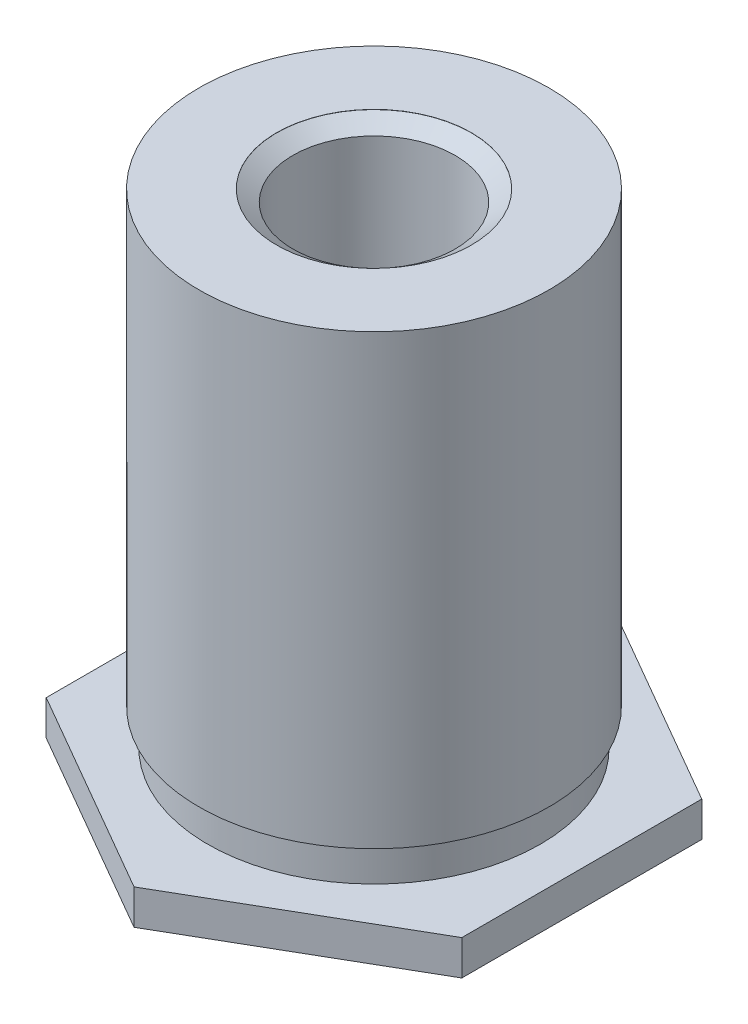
ISO-10303-21;
HEADER;
FILE_DESCRIPTION(('STEP AP214'),'2;1');
FILE_NAME('part.step','',(''),(''),'','','');
FILE_SCHEMA(('AUTOMOTIVE_DESIGN { 1 0 10303 214 1 1 1 1 }'));
ENDSEC;
DATA;
#1=APPLICATION_CONTEXT('core data for automotive mechanical design processes');
#2=APPLICATION_PROTOCOL_DEFINITION('international standard','automotive_design',2000,#1);
#3=PRODUCT_CONTEXT('',#1,'mechanical');
#4=PRODUCT('Part','Part','',(#3));
#5=PRODUCT_RELATED_PRODUCT_CATEGORY('part','',(#4));
#6=PRODUCT_DEFINITION_FORMATION('','',#4);
#7=PRODUCT_DEFINITION_CONTEXT('part definition',#1,'design');
#8=PRODUCT_DEFINITION('design','',#6,#7);
#9=PRODUCT_DEFINITION_SHAPE('','',#8);
#10=(LENGTH_UNIT() NAMED_UNIT(*) SI_UNIT(.MILLI.,.METRE.));
#11=(NAMED_UNIT(*) PLANE_ANGLE_UNIT() SI_UNIT($,.RADIAN.));
#12=(NAMED_UNIT(*) SI_UNIT($,.STERADIAN.) SOLID_ANGLE_UNIT());
#13=UNCERTAINTY_MEASURE_WITH_UNIT(LENGTH_MEASURE(1.E-05),#10,'distance_accuracy_value','');
#14=(GEOMETRIC_REPRESENTATION_CONTEXT(3) GLOBAL_UNCERTAINTY_ASSIGNED_CONTEXT((#13)) GLOBAL_UNIT_ASSIGNED_CONTEXT((#10,
#11,#12)) REPRESENTATION_CONTEXT('',''));
#15=CARTESIAN_POINT('',(0.,0.,0.));
#16=DIRECTION('',(0.,0.,1.));
#17=DIRECTION('',(1.,0.,0.));
#18=AXIS2_PLACEMENT_3D('',#15,#16,#17);
#19=CARTESIAN_POINT('',(0.,0.982233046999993,0.));
#20=DIRECTION('',(0.,1.,0.));
#21=DIRECTION('',(0.,0.,0.999999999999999));
#22=AXIS2_PLACEMENT_3D('',#19,#20,#21);
#23=CONICAL_SURFACE('',#22,0.,1.17809724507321);
#24=CARTESIAN_POINT('',(0.,0.982233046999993,0.));
#25=VERTEX_POINT('',#24);
#26=VERTEX_LOOP('',#25);
#27=FACE_BOUND('',#26,.T.);
#28=CARTESIAN_POINT('',(0.,1.49999999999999,0.));
#29=DIRECTION('',(0.,-1.,0.));
#30=DIRECTION('',(0.,0.,-0.999999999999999));
#31=AXIS2_PLACEMENT_3D('',#28,#29,#30);
#32=CIRCLE('',#31,1.25);
#33=CARTESIAN_POINT('',(0.,1.49999999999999,-1.25));
#34=VERTEX_POINT('',#33);
#35=EDGE_CURVE('E132',#34,#34,#32,.T.);
#36=ORIENTED_EDGE('',*,*,#35,.F.);
#37=EDGE_LOOP('',(#36));
#38=FACE_BOUND('',#37,.T.);
#39=ADVANCED_FACE('F16',(#27,#38),#23,.F.);
#40=CARTESIAN_POINT('',(0.,7.82247313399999,0.));
#41=DIRECTION('',(0.,-1.,0.));
#42=DIRECTION('',(0.,0.,-0.999999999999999));
#43=AXIS2_PLACEMENT_3D('',#40,#41,#42);
#44=CYLINDRICAL_SURFACE('',#43,1.25);
#45=CARTESIAN_POINT('',(0.,7.82247313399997,0.));
#46=DIRECTION('',(0.,1.,0.));
#47=DIRECTION('',(0.,0.,0.999999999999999));
#48=AXIS2_PLACEMENT_3D('',#45,#46,#47);
#49=CIRCLE('',#48,1.25);
#50=CARTESIAN_POINT('',(0.,7.82247313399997,-1.25));
#51=VERTEX_POINT('',#50);
#52=EDGE_CURVE('E128',#51,#51,#49,.F.);
#53=CARTESIAN_POINT('',(0.,7.82247313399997,-1.25));
#54=CARTESIAN_POINT('',(0.,7.75661403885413,-1.25));
#55=CARTESIAN_POINT('',(0.,7.6907549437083,-1.25));
#56=CARTESIAN_POINT('',(0.,7.55903675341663,-1.25));
#57=CARTESIAN_POINT('',(0.,7.4931776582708,-1.25));
#58=CARTESIAN_POINT('',(0.,7.36145946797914,-1.25));
#59=CARTESIAN_POINT('',(0.,7.2956003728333,-1.25));
#60=CARTESIAN_POINT('',(0.,7.16388218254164,-1.25));
#61=CARTESIAN_POINT('',(0.,7.0980230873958,-1.25));
#62=CARTESIAN_POINT('',(0.,6.96630489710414,-1.25));
#63=CARTESIAN_POINT('',(0.,6.9004458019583,-1.25));
#64=CARTESIAN_POINT('',(0.,6.76872761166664,-1.25));
#65=CARTESIAN_POINT('',(0.,6.7028685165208,-1.25));
#66=CARTESIAN_POINT('',(0.,6.57115032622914,-1.25));
#67=CARTESIAN_POINT('',(0.,6.50529123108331,-1.25));
#68=CARTESIAN_POINT('',(0.,6.37357304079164,-1.25));
#69=CARTESIAN_POINT('',(0.,6.30771394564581,-1.25));
#70=CARTESIAN_POINT('',(0.,6.17599575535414,-1.25));
#71=CARTESIAN_POINT('',(0.,6.11013666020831,-1.25));
#72=CARTESIAN_POINT('',(0.,5.97841846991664,-1.25));
#73=CARTESIAN_POINT('',(0.,5.91255937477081,-1.25));
#74=CARTESIAN_POINT('',(0.,5.78084118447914,-1.25));
#75=CARTESIAN_POINT('',(0.,5.71498208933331,-1.25));
#76=CARTESIAN_POINT('',(0.,5.58326389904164,-1.25));
#77=CARTESIAN_POINT('',(0.,5.51740480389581,-1.25));
#78=CARTESIAN_POINT('',(0.,5.38568661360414,-1.25));
#79=CARTESIAN_POINT('',(0.,5.31982751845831,-1.25));
#80=CARTESIAN_POINT('',(0.,5.18810932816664,-1.25));
#81=CARTESIAN_POINT('',(0.,5.12225023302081,-1.25));
#82=CARTESIAN_POINT('',(0.,4.99053204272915,-1.25));
#83=CARTESIAN_POINT('',(0.,4.92467294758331,-1.25));
#84=CARTESIAN_POINT('',(0.,4.79295475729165,-1.25));
#85=CARTESIAN_POINT('',(0.,4.72709566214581,-1.25));
#86=CARTESIAN_POINT('',(0.,4.59537747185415,-1.25));
#87=CARTESIAN_POINT('',(0.,4.52951837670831,-1.25));
#88=CARTESIAN_POINT('',(0.,4.39780018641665,-1.25));
#89=CARTESIAN_POINT('',(0.,4.33194109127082,-1.25));
#90=CARTESIAN_POINT('',(0.,4.20022290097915,-1.25));
#91=CARTESIAN_POINT('',(0.,4.13436380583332,-1.25));
#92=CARTESIAN_POINT('',(0.,4.00264561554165,-1.25));
#93=CARTESIAN_POINT('',(0.,3.93678652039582,-1.25));
#94=CARTESIAN_POINT('',(0.,3.80506833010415,-1.25));
#95=CARTESIAN_POINT('',(0.,3.73920923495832,-1.25));
#96=CARTESIAN_POINT('',(0.,3.60749104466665,-1.25));
#97=CARTESIAN_POINT('',(0.,3.54163194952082,-1.25));
#98=CARTESIAN_POINT('',(0.,3.40991375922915,-1.25));
#99=CARTESIAN_POINT('',(0.,3.34405466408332,-1.25));
#100=CARTESIAN_POINT('',(0.,3.21233647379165,-1.25));
#101=CARTESIAN_POINT('',(0.,3.14647737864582,-1.25));
#102=CARTESIAN_POINT('',(0.,3.01475918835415,-1.25));
#103=CARTESIAN_POINT('',(0.,2.94890009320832,-1.25));
#104=CARTESIAN_POINT('',(0.,2.81718190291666,-1.25));
#105=CARTESIAN_POINT('',(0.,2.75132280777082,-1.25));
#106=CARTESIAN_POINT('',(0.,2.61960461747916,-1.25));
#107=CARTESIAN_POINT('',(0.,2.55374552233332,-1.25));
#108=CARTESIAN_POINT('',(0.,2.42202733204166,-1.25));
#109=CARTESIAN_POINT('',(0.,2.35616823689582,-1.25));
#110=CARTESIAN_POINT('',(0.,2.22445004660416,-1.25));
#111=CARTESIAN_POINT('',(0.,2.15859095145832,-1.25));
#112=CARTESIAN_POINT('',(0.,2.02687276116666,-1.25));
#113=CARTESIAN_POINT('',(0.,1.96101366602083,-1.25));
#114=CARTESIAN_POINT('',(0.,1.82929547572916,-1.25));
#115=CARTESIAN_POINT('',(0.,1.76343638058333,-1.25));
#116=CARTESIAN_POINT('',(0.,1.63171819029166,-1.25));
#117=CARTESIAN_POINT('',(0.,1.56585909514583,-1.25));
#118=CARTESIAN_POINT('',(0.,1.49999999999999,-1.25));
#119=B_SPLINE_CURVE_WITH_KNOTS('',3,(#53,#54,#55,#56,#57,#58,#59,#60,#61,#62,#63,#64,#65,#66,
#67,#68,#69,#70,#71,#72,#73,#74,#75,#76,#77,#78,#79,#80,#81,#82,#83,#84,#85,#86,#87,#88,#89,#90,
#91,#92,#93,#94,#95,#96,#97,#98,#99,#100,#101,#102,#103,#104,#105,#106,#107,#108,#109,#110,#111,
#112,#113,#114,#115,#116,#117,#118),.UNSPECIFIED.,.F.,.F.,(4,2,2,2,2,2,2,2,2,2,2,2,2,2,2,2,2,2,
2,2,2,2,2,2,2,2,2,2,2,2,2,2,4),(0.,0.1975772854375,0.395154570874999,0.592731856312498,
0.790309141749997,0.987886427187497,1.185463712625,1.38304099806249,1.58061828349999,
1.77819556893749,1.97577285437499,2.17335013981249,2.37092742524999,2.56850471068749,
2.76608199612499,2.96365928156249,3.16123656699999,3.35881385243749,3.55639113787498,
3.75396842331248,3.95154570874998,4.14912299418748,4.34670027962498,4.54427756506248,
4.74185485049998,4.93943213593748,5.13700942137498,5.33458670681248,5.53216399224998,
5.72974127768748,5.92731856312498,6.12489584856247,6.32247313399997),.UNSPECIFIED.);
#120=EDGE_CURVE('BSEAM190',#51,#34,#119,.T.);
#121=ORIENTED_EDGE('',*,*,#52,.F.);
#122=ORIENTED_EDGE('',*,*,#35,.T.);
#123=ORIENTED_EDGE('',*,*,#120,.T.);
#124=ORIENTED_EDGE('',*,*,#120,.F.);
#125=EDGE_LOOP('',(#121,#123,#122,#124));
#126=FACE_BOUND('',#125,.T.);
#127=ADVANCED_FACE('F190',(#126),#44,.F.);
#128=CARTESIAN_POINT('',(0.,7.82247313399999,0.));
#129=DIRECTION('',(0.,1.,0.));
#130=DIRECTION('',(0.,0.,0.999999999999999));
#131=AXIS2_PLACEMENT_3D('',#128,#129,#130);
#132=CONICAL_SURFACE('',#131,1.25,0.96010562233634);
#133=ORIENTED_EDGE('',*,*,#52,.T.);
#134=EDGE_LOOP('',(#133));
#135=FACE_BOUND('',#134,.T.);
#136=CARTESIAN_POINT('',(0.,7.99745999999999,0.));
#137=DIRECTION('',(0.,-1.,0.));
#138=DIRECTION('',(0.,0.,-0.999999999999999));
#139=AXIS2_PLACEMENT_3D('',#136,#137,#138);
#140=CIRCLE('',#139,1.5);
#141=CARTESIAN_POINT('',(0.,7.99745999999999,-1.5));
#142=VERTEX_POINT('',#141);
#143=EDGE_CURVE('E124',#142,#142,#140,.T.);
#144=ORIENTED_EDGE('',*,*,#143,.F.);
#145=EDGE_LOOP('',(#144));
#146=FACE_BOUND('',#145,.T.);
#147=ADVANCED_FACE('F185',(#135,#146),#132,.F.);
#148=CARTESIAN_POINT('',(0.,8.,0.));
#149=DIRECTION('',(0.,-1.,0.));
#150=DIRECTION('',(0.,0.,-0.999999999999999));
#151=AXIS2_PLACEMENT_3D('',#148,#149,#150);
#152=CYLINDRICAL_SURFACE('',#151,1.5);
#153=CARTESIAN_POINT('',(0.,8.,0.));
#154=DIRECTION('',(0.,-1.,0.));
#155=DIRECTION('',(0.,0.,-0.999999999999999));
#156=AXIS2_PLACEMENT_3D('',#153,#154,#155);
#157=CIRCLE('',#156,1.5);
#158=CARTESIAN_POINT('',(0.,8.,-1.5));
#159=VERTEX_POINT('',#158);
#160=EDGE_CURVE('E20',#159,#159,#157,.T.);
#161=CARTESIAN_POINT('',(0.,8.,-1.5));
#162=CARTESIAN_POINT('',(0.,7.99997354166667,-1.5));
#163=CARTESIAN_POINT('',(0.,7.99994708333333,-1.5));
#164=CARTESIAN_POINT('',(0.,7.99989416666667,-1.5));
#165=CARTESIAN_POINT('',(0.,7.99986770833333,-1.5));
#166=CARTESIAN_POINT('',(0.,7.99981479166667,-1.5));
#167=CARTESIAN_POINT('',(0.,7.99978833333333,-1.5));
#168=CARTESIAN_POINT('',(0.,7.99973541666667,-1.5));
#169=CARTESIAN_POINT('',(0.,7.99970895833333,-1.5));
#170=CARTESIAN_POINT('',(0.,7.99965604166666,-1.5));
#171=CARTESIAN_POINT('',(0.,7.99962958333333,-1.5));
#172=CARTESIAN_POINT('',(0.,7.99957666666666,-1.5));
#173=CARTESIAN_POINT('',(0.,7.99955020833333,-1.5));
#174=CARTESIAN_POINT('',(0.,7.99949729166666,-1.5));
#175=CARTESIAN_POINT('',(0.,7.99947083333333,-1.5));
#176=CARTESIAN_POINT('',(0.,7.99941791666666,-1.5));
#177=CARTESIAN_POINT('',(0.,7.99939145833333,-1.5));
#178=CARTESIAN_POINT('',(0.,7.99933854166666,-1.5));
#179=CARTESIAN_POINT('',(0.,7.99931208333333,-1.5));
#180=CARTESIAN_POINT('',(0.,7.99925916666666,-1.5));
#181=CARTESIAN_POINT('',(0.,7.99923270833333,-1.5));
#182=CARTESIAN_POINT('',(0.,7.99917979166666,-1.5));
#183=CARTESIAN_POINT('',(0.,7.99915333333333,-1.5));
#184=CARTESIAN_POINT('',(0.,7.99910041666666,-1.5));
#185=CARTESIAN_POINT('',(0.,7.99907395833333,-1.5));
#186=CARTESIAN_POINT('',(0.,7.99902104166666,-1.5));
#187=CARTESIAN_POINT('',(0.,7.99899458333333,-1.5));
#188=CARTESIAN_POINT('',(0.,7.99894166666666,-1.5));
#189=CARTESIAN_POINT('',(0.,7.99891520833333,-1.5));
#190=CARTESIAN_POINT('',(0.,7.99886229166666,-1.5));
#191=CARTESIAN_POINT('',(0.,7.99883583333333,-1.5));
#192=CARTESIAN_POINT('',(0.,7.99878291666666,-1.5));
#193=CARTESIAN_POINT('',(0.,7.99875645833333,-1.5));
#194=CARTESIAN_POINT('',(0.,7.99870354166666,-1.5));
#195=CARTESIAN_POINT('',(0.,7.99867708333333,-1.5));
#196=CARTESIAN_POINT('',(0.,7.99862416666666,-1.5));
#197=CARTESIAN_POINT('',(0.,7.99859770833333,-1.5));
#198=CARTESIAN_POINT('',(0.,7.99854479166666,-1.5));
#199=CARTESIAN_POINT('',(0.,7.99851833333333,-1.5));
#200=CARTESIAN_POINT('',(0.,7.99846541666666,-1.5));
#201=CARTESIAN_POINT('',(0.,7.99843895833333,-1.5));
#202=CARTESIAN_POINT('',(0.,7.99838604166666,-1.5));
#203=CARTESIAN_POINT('',(0.,7.99835958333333,-1.5));
#204=CARTESIAN_POINT('',(0.,7.99830666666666,-1.5));
#205=CARTESIAN_POINT('',(0.,7.99828020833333,-1.5));
#206=CARTESIAN_POINT('',(0.,7.99822729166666,-1.5));
#207=CARTESIAN_POINT('',(0.,7.99820083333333,-1.5));
#208=CARTESIAN_POINT('',(0.,7.99814791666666,-1.5));
#209=CARTESIAN_POINT('',(0.,7.99812145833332,-1.5));
#210=CARTESIAN_POINT('',(0.,7.99806854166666,-1.5));
#211=CARTESIAN_POINT('',(0.,7.99804208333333,-1.5));
#212=CARTESIAN_POINT('',(0.,7.99798916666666,-1.5));
#213=CARTESIAN_POINT('',(0.,7.99796270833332,-1.5));
#214=CARTESIAN_POINT('',(0.,7.99790979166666,-1.5));
#215=CARTESIAN_POINT('',(0.,7.99788333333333,-1.5));
#216=CARTESIAN_POINT('',(0.,7.99783041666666,-1.5));
#217=CARTESIAN_POINT('',(0.,7.99780395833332,-1.5));
#218=CARTESIAN_POINT('',(0.,7.99775104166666,-1.5));
#219=CARTESIAN_POINT('',(0.,7.99772458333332,-1.5));
#220=CARTESIAN_POINT('',(0.,7.99767166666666,-1.5));
#221=CARTESIAN_POINT('',(0.,7.99764520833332,-1.5));
#222=CARTESIAN_POINT('',(0.,7.99759229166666,-1.5));
#223=CARTESIAN_POINT('',(0.,7.99756583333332,-1.5));
#224=CARTESIAN_POINT('',(0.,7.99751291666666,-1.5));
#225=CARTESIAN_POINT('',(0.,7.99748645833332,-1.5));
#226=CARTESIAN_POINT('',(0.,7.99745999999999,-1.5));
#227=B_SPLINE_CURVE_WITH_KNOTS('',3,(#161,#162,#163,#164,#165,#166,#167,#168,#169,#170,#171,
#172,#173,#174,#175,#176,#177,#178,#179,#180,#181,#182,#183,#184,#185,#186,#187,#188,#189,#190,
#191,#192,#193,#194,#195,#196,#197,#198,#199,#200,#201,#202,#203,#204,#205,#206,#207,#208,#209,
#210,#211,#212,#213,#214,#215,#216,#217,#218,#219,#220,#221,#222,#223,#224,#225,#226),
.UNSPECIFIED.,.F.,.F.,(4,2,2,2,2,2,2,2,2,2,2,2,2,2,2,2,2,2,2,2,2,2,2,2,2,2,2,2,2,2,2,2,4),(0.,
7.93749999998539E-05,0.000158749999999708,0.000238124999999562,0.00031750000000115,
0.000396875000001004,0.000476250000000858,0.000555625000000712,0.0006350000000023,
0.000714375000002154,0.000793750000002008,0.000873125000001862,0.000952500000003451,
0.0010318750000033,0.00111125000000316,0.00119062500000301,0.0012700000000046,
0.00134937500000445,0.00142875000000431,0.00150812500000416,0.00158750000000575,
0.0016668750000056,0.00174625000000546,0.00182562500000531,0.0019050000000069,
0.00198437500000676,0.00206375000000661,0.00214312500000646,0.00222250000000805,
0.00230187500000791,0.00238125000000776,0.00246062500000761,0.0025400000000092),.UNSPECIFIED.);
#228=EDGE_CURVE('BSEAM182',#159,#142,#227,.T.);
#229=ORIENTED_EDGE('',*,*,#160,.F.);
#230=ORIENTED_EDGE('',*,*,#143,.T.);
#231=ORIENTED_EDGE('',*,*,#228,.T.);
#232=ORIENTED_EDGE('',*,*,#228,.F.);
#233=EDGE_LOOP('',(#229,#231,#230,#232));
#234=FACE_BOUND('',#233,.T.);
#235=ADVANCED_FACE('F182',(#234),#152,.F.);
#236=CARTESIAN_POINT('',(-2.72734000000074,8.00000000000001,-2.72733999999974));
#237=DIRECTION('',(0.,1.,0.));
#238=DIRECTION('',(0.,0.,0.999999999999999));
#239=AXIS2_PLACEMENT_3D('',#236,#237,#238);
#240=PLANE('',#239);
#241=ORIENTED_EDGE('',*,*,#160,.T.);
#242=EDGE_LOOP('',(#241));
#243=FACE_BOUND('',#242,.T.);
#244=CARTESIAN_POINT('',(0.,8.,0.));
#245=DIRECTION('',(0.,-1.,0.));
#246=DIRECTION('',(0.,0.,-0.999999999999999));
#247=AXIS2_PLACEMENT_3D('',#244,#245,#246);
#248=CIRCLE('',#247,2.695);
#249=CARTESIAN_POINT('',(0.,8.,-2.695));
#250=VERTEX_POINT('',#249);
#251=EDGE_CURVE('E171',#250,#250,#248,.F.);
#252=ORIENTED_EDGE('',*,*,#251,.T.);
#253=EDGE_LOOP('',(#252));
#254=FACE_BOUND('',#253,.T.);
#255=ADVANCED_FACE('F180',(#243,#254),#240,.T.);
#256=CARTESIAN_POINT('',(0.,8.,0.));
#257=DIRECTION('',(0.,-1.,0.));
#258=DIRECTION('',(0.,0.,-0.999999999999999));
#259=AXIS2_PLACEMENT_3D('',#256,#257,#258);
#260=CYLINDRICAL_SURFACE('',#259,2.695);
#261=CARTESIAN_POINT('',(0.,1.10495,0.));
#262=DIRECTION('',(0.,-1.,0.));
#263=DIRECTION('',(0.,0.,-0.999999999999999));
#264=AXIS2_PLACEMENT_3D('',#261,#262,#263);
#265=CIRCLE('',#264,2.695);
#266=CARTESIAN_POINT('',(0.,1.10495,-2.695));
#267=VERTEX_POINT('',#266);
#268=EDGE_CURVE('E168',#267,#267,#265,.T.);
#269=CARTESIAN_POINT('',(0.,8.,-2.695));
#270=CARTESIAN_POINT('',(0.,7.9281765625,-2.695));
#271=CARTESIAN_POINT('',(0.,7.856353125,-2.695));
#272=CARTESIAN_POINT('',(0.,7.71270625,-2.695));
#273=CARTESIAN_POINT('',(0.,7.6408828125,-2.695));
#274=CARTESIAN_POINT('',(0.,7.4972359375,-2.695));
#275=CARTESIAN_POINT('',(0.,7.4254125,-2.695));
#276=CARTESIAN_POINT('',(0.,7.281765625,-2.695));
#277=CARTESIAN_POINT('',(0.,7.2099421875,-2.695));
#278=CARTESIAN_POINT('',(0.,7.0662953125,-2.695));
#279=CARTESIAN_POINT('',(0.,6.994471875,-2.695));
#280=CARTESIAN_POINT('',(0.,6.850825,-2.695));
#281=CARTESIAN_POINT('',(0.,6.7790015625,-2.695));
#282=CARTESIAN_POINT('',(0.,6.6353546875,-2.695));
#283=CARTESIAN_POINT('',(0.,6.56353125,-2.695));
#284=CARTESIAN_POINT('',(0.,6.419884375,-2.695));
#285=CARTESIAN_POINT('',(0.,6.3480609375,-2.695));
#286=CARTESIAN_POINT('',(0.,6.2044140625,-2.695));
#287=CARTESIAN_POINT('',(0.,6.132590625,-2.695));
#288=CARTESIAN_POINT('',(0.,5.98894375,-2.695));
#289=CARTESIAN_POINT('',(0.,5.9171203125,-2.695));
#290=CARTESIAN_POINT('',(0.,5.7734734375,-2.695));
#291=CARTESIAN_POINT('',(0.,5.70165,-2.695));
#292=CARTESIAN_POINT('',(0.,5.558003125,-2.695));
#293=CARTESIAN_POINT('',(0.,5.4861796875,-2.695));
#294=CARTESIAN_POINT('',(0.,5.3425328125,-2.695));
#295=CARTESIAN_POINT('',(0.,5.270709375,-2.695));
#296=CARTESIAN_POINT('',(0.,5.1270625,-2.695));
#297=CARTESIAN_POINT('',(0.,5.0552390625,-2.695));
#298=CARTESIAN_POINT('',(0.,4.9115921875,-2.695));
#299=CARTESIAN_POINT('',(0.,4.83976875,-2.695));
#300=CARTESIAN_POINT('',(0.,4.696121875,-2.695));
#301=CARTESIAN_POINT('',(0.,4.6242984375,-2.695));
#302=CARTESIAN_POINT('',(0.,4.4806515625,-2.695));
#303=CARTESIAN_POINT('',(0.,4.408828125,-2.695));
#304=CARTESIAN_POINT('',(0.,4.26518125,-2.695));
#305=CARTESIAN_POINT('',(0.,4.1933578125,-2.695));
#306=CARTESIAN_POINT('',(0.,4.0497109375,-2.695));
#307=CARTESIAN_POINT('',(0.,3.9778875,-2.695));
#308=CARTESIAN_POINT('',(0.,3.834240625,-2.695));
#309=CARTESIAN_POINT('',(0.,3.7624171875,-2.695));
#310=CARTESIAN_POINT('',(0.,3.6187703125,-2.695));
#311=CARTESIAN_POINT('',(0.,3.546946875,-2.695));
#312=CARTESIAN_POINT('',(0.,3.4033,-2.695));
#313=CARTESIAN_POINT('',(0.,3.3314765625,-2.695));
#314=CARTESIAN_POINT('',(0.,3.1878296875,-2.695));
#315=CARTESIAN_POINT('',(0.,3.11600625,-2.695));
#316=CARTESIAN_POINT('',(0.,2.972359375,-2.695));
#317=CARTESIAN_POINT('',(0.,2.9005359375,-2.695));
#318=CARTESIAN_POINT('',(0.,2.7568890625,-2.695));
#319=CARTESIAN_POINT('',(0.,2.685065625,-2.695));
#320=CARTESIAN_POINT('',(0.,2.54141875,-2.695));
#321=CARTESIAN_POINT('',(0.,2.4695953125,-2.695));
#322=CARTESIAN_POINT('',(0.,2.3259484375,-2.695));
#323=CARTESIAN_POINT('',(0.,2.254125,-2.695));
#324=CARTESIAN_POINT('',(0.,2.110478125,-2.695));
#325=CARTESIAN_POINT('',(0.,2.0386546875,-2.695));
#326=CARTESIAN_POINT('',(0.,1.8950078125,-2.695));
#327=CARTESIAN_POINT('',(0.,1.823184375,-2.695));
#328=CARTESIAN_POINT('',(0.,1.6795375,-2.695));
#329=CARTESIAN_POINT('',(0.,1.6077140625,-2.695));
#330=CARTESIAN_POINT('',(0.,1.4640671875,-2.695));
#331=CARTESIAN_POINT('',(0.,1.39224375,-2.695));
#332=CARTESIAN_POINT('',(0.,1.248596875,-2.695));
#333=CARTESIAN_POINT('',(0.,1.1767734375,-2.695));
#334=CARTESIAN_POINT('',(0.,1.10495,-2.695));
#335=B_SPLINE_CURVE_WITH_KNOTS('',3,(#269,#270,#271,#272,#273,#274,#275,#276,#277,#278,#279,
#280,#281,#282,#283,#284,#285,#286,#287,#288,#289,#290,#291,#292,#293,#294,#295,#296,#297,#298,
#299,#300,#301,#302,#303,#304,#305,#306,#307,#308,#309,#310,#311,#312,#313,#314,#315,#316,#317,
#318,#319,#320,#321,#322,#323,#324,#325,#326,#327,#328,#329,#330,#331,#332,#333,#334),
.UNSPECIFIED.,.F.,.F.,(4,2,2,2,2,2,2,2,2,2,2,2,2,2,2,2,2,2,2,2,2,2,2,2,2,2,2,2,2,2,2,2,4),(0.,
0.2154703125,0.430940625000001,0.6464109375,0.861881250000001,1.0773515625,1.292821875,
1.5082921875,1.7237625,1.9392328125,2.154703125,2.3701734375,2.58564375,2.8011140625,
3.016584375,3.2320546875,3.447525,3.6629953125,3.878465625,4.0939359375,4.30940625,4.5248765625,
4.740346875,4.9558171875,5.1712875,5.3867578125,5.602228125,5.8176984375,6.03316875,
6.2486390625,6.464109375,6.6795796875,6.89505),.UNSPECIFIED.);
#336=EDGE_CURVE('BSEAM215',#250,#267,#335,.T.);
#337=ORIENTED_EDGE('',*,*,#251,.F.);
#338=ORIENTED_EDGE('',*,*,#268,.F.);
#339=ORIENTED_EDGE('',*,*,#336,.T.);
#340=ORIENTED_EDGE('',*,*,#336,.F.);
#341=EDGE_LOOP('',(#337,#339,#338,#340));
#342=FACE_BOUND('',#341,.T.);
#343=ADVANCED_FACE('F215',(#342),#260,.T.);
#344=CARTESIAN_POINT('',(-2.72734000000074,1.10495,2.72733999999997));
#345=DIRECTION('',(0.,-1.,0.));
#346=DIRECTION('',(0.,0.,-0.999999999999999));
#347=AXIS2_PLACEMENT_3D('',#344,#345,#346);
#348=PLANE('',#347);
#349=CARTESIAN_POINT('',(0.,1.10495,0.));
#350=DIRECTION('',(0.,-1.,0.));
#351=DIRECTION('',(1.,0.,0.));
#352=AXIS2_PLACEMENT_3D('',#349,#350,#351);
#353=CIRCLE('',#352,2.56025);
#354=CARTESIAN_POINT('',(2.56025,1.10495,0.));
#355=VERTEX_POINT('',#354);
#356=EDGE_CURVE('E164',#355,#355,#353,.F.);
#357=ORIENTED_EDGE('',*,*,#356,.T.);
#358=EDGE_LOOP('',(#357));
#359=FACE_BOUND('',#358,.T.);
#360=ORIENTED_EDGE('',*,*,#268,.T.);
#361=EDGE_LOOP('',(#360));
#362=FACE_BOUND('',#361,.T.);
#363=ADVANCED_FACE('F213',(#359,#362),#348,.T.);
#364=CARTESIAN_POINT('',(0.,1.10495,0.));
#365=DIRECTION('',(0.,-1.,0.));
#366=DIRECTION('',(1.,0.,0.));
#367=AXIS2_PLACEMENT_3D('',#364,#365,#366);
#368=CYLINDRICAL_SURFACE('',#367,2.56025);
#369=CARTESIAN_POINT('',(0.,0.539000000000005,0.));
#370=DIRECTION('',(0.,-1.,0.));
#371=DIRECTION('',(1.,0.,0.));
#372=AXIS2_PLACEMENT_3D('',#369,#370,#371);
#373=CIRCLE('',#372,2.56025);
#374=CARTESIAN_POINT('',(2.56025,0.539000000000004,0.));
#375=VERTEX_POINT('',#374);
#376=EDGE_CURVE('E123',#375,#375,#373,.T.);
#377=CARTESIAN_POINT('',(2.56025,1.10495,0.));
#378=CARTESIAN_POINT('',(2.56025,1.0990546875,0.));
#379=CARTESIAN_POINT('',(2.56025,1.093159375,0.));
#380=CARTESIAN_POINT('',(2.56025,1.08136875,0.));
#381=CARTESIAN_POINT('',(2.56025,1.0754734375,0.));
#382=CARTESIAN_POINT('',(2.56025,1.0636828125,0.));
#383=CARTESIAN_POINT('',(2.56025,1.0577875,0.));
#384=CARTESIAN_POINT('',(2.56025,1.045996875,0.));
#385=CARTESIAN_POINT('',(2.56025,1.0401015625,0.));
#386=CARTESIAN_POINT('',(2.56025,1.0283109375,0.));
#387=CARTESIAN_POINT('',(2.56025,1.022415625,0.));
#388=CARTESIAN_POINT('',(2.56025,1.010625,0.));
#389=CARTESIAN_POINT('',(2.56025,1.0047296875,0.));
#390=CARTESIAN_POINT('',(2.56025,0.992939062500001,0.));
#391=CARTESIAN_POINT('',(2.56025,0.987043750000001,0.));
#392=CARTESIAN_POINT('',(2.56025,0.975253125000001,0.));
#393=CARTESIAN_POINT('',(2.56025,0.969357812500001,0.));
#394=CARTESIAN_POINT('',(2.56025,0.957567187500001,0.));
#395=CARTESIAN_POINT('',(2.56025,0.951671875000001,0.));
#396=CARTESIAN_POINT('',(2.56025,0.939881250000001,0.));
#397=CARTESIAN_POINT('',(2.56025,0.933985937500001,0.));
#398=CARTESIAN_POINT('',(2.56025,0.922195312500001,0.));
#399=CARTESIAN_POINT('',(2.56025,0.916300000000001,0.));
#400=CARTESIAN_POINT('',(2.56025,0.904509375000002,0.));
#401=CARTESIAN_POINT('',(2.56025,0.898614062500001,0.));
#402=CARTESIAN_POINT('',(2.56025,0.886823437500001,0.));
#403=CARTESIAN_POINT('',(2.56025,0.880928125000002,0.));
#404=CARTESIAN_POINT('',(2.56025,0.869137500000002,0.));
#405=CARTESIAN_POINT('',(2.56025,0.863242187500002,0.));
#406=CARTESIAN_POINT('',(2.56025,0.851451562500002,0.));
#407=CARTESIAN_POINT('',(2.56025,0.845556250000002,0.));
#408=CARTESIAN_POINT('',(2.56025,0.833765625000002,0.));
#409=CARTESIAN_POINT('',(2.56025,0.827870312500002,0.));
#410=CARTESIAN_POINT('',(2.56025,0.816079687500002,0.));
#411=CARTESIAN_POINT('',(2.56025,0.810184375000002,0.));
#412=CARTESIAN_POINT('',(2.56025,0.798393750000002,0.));
#413=CARTESIAN_POINT('',(2.56025,0.792498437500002,0.));
#414=CARTESIAN_POINT('',(2.56025,0.780707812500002,0.));
#415=CARTESIAN_POINT('',(2.56025,0.774812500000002,0.));
#416=CARTESIAN_POINT('',(2.56025,0.763021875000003,0.));
#417=CARTESIAN_POINT('',(2.56025,0.757126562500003,0.));
#418=CARTESIAN_POINT('',(2.56025,0.745335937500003,0.));
#419=CARTESIAN_POINT('',(2.56025,0.739440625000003,0.));
#420=CARTESIAN_POINT('',(2.56025,0.727650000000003,0.));
#421=CARTESIAN_POINT('',(2.56025,0.721754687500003,0.));
#422=CARTESIAN_POINT('',(2.56025,0.709964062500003,0.));
#423=CARTESIAN_POINT('',(2.56025,0.704068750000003,0.));
#424=CARTESIAN_POINT('',(2.56025,0.692278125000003,0.));
#425=CARTESIAN_POINT('',(2.56025,0.686382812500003,0.));
#426=CARTESIAN_POINT('',(2.56025,0.674592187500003,0.));
#427=CARTESIAN_POINT('',(2.56025,0.668696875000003,0.));
#428=CARTESIAN_POINT('',(2.56025,0.656906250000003,0.));
#429=CARTESIAN_POINT('',(2.56025,0.651010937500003,0.));
#430=CARTESIAN_POINT('',(2.56025,0.639220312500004,0.));
#431=CARTESIAN_POINT('',(2.56025,0.633325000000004,0.));
#432=CARTESIAN_POINT('',(2.56025,0.621534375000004,0.));
#433=CARTESIAN_POINT('',(2.56025,0.615639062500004,0.));
#434=CARTESIAN_POINT('',(2.56025,0.603848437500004,0.));
#435=CARTESIAN_POINT('',(2.56025,0.597953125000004,0.));
#436=CARTESIAN_POINT('',(2.56025,0.586162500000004,0.));
#437=CARTESIAN_POINT('',(2.56025,0.580267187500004,0.));
#438=CARTESIAN_POINT('',(2.56025,0.568476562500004,0.));
#439=CARTESIAN_POINT('',(2.56025,0.562581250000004,0.));
#440=CARTESIAN_POINT('',(2.56025,0.550790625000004,0.));
#441=CARTESIAN_POINT('',(2.56025,0.544895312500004,0.));
#442=CARTESIAN_POINT('',(2.56025,0.539000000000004,0.));
#443=B_SPLINE_CURVE_WITH_KNOTS('',3,(#377,#378,#379,#380,#381,#382,#383,#384,#385,#386,#387,
#388,#389,#390,#391,#392,#393,#394,#395,#396,#397,#398,#399,#400,#401,#402,#403,#404,#405,#406,
#407,#408,#409,#410,#411,#412,#413,#414,#415,#416,#417,#418,#419,#420,#421,#422,#423,#424,#425,
#426,#427,#428,#429,#430,#431,#432,#433,#434,#435,#436,#437,#438,#439,#440,#441,#442),
.UNSPECIFIED.,.F.,.F.,(4,2,2,2,2,2,2,2,2,2,2,2,2,2,2,2,2,2,2,2,2,2,2,2,2,2,2,2,2,2,2,2,4),(0.,
0.0176859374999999,0.0353718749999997,0.0530578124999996,0.0707437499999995,0.0884296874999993,
0.106115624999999,0.123801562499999,0.141487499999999,0.159173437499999,0.176859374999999,
0.194545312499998,0.212231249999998,0.229917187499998,0.247603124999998,0.265289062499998,
0.282974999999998,0.300660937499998,0.318346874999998,0.336032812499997,0.353718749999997,
0.371404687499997,0.389090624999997,0.406776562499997,0.424462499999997,0.442148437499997,
0.459834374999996,0.477520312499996,0.495206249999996,0.512892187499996,0.530578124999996,
0.548264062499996,0.565949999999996),.UNSPECIFIED.);
#444=EDGE_CURVE('BSEAM210',#355,#375,#443,.T.);
#445=ORIENTED_EDGE('',*,*,#356,.F.);
#446=ORIENTED_EDGE('',*,*,#376,.F.);
#447=ORIENTED_EDGE('',*,*,#444,.T.);
#448=ORIENTED_EDGE('',*,*,#444,.F.);
#449=EDGE_LOOP('',(#445,#447,#446,#448));
#450=FACE_BOUND('',#449,.T.);
#451=ADVANCED_FACE('F210',(#450),#368,.T.);
#452=CARTESIAN_POINT('',(-3.20000000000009,0.538999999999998,-3.73938222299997));
#453=DIRECTION('',(0.,1.,0.));
#454=DIRECTION('',(0.,0.,0.999999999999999));
#455=AXIS2_PLACEMENT_3D('',#452,#453,#454);
#456=PLANE('',#455);
#457=ORIENTED_EDGE('',*,*,#376,.T.);
#458=EDGE_LOOP('',(#457));
#459=FACE_BOUND('',#458,.T.);
#460=DIRECTION('',(0.866025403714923,0.,-0.500000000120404));
#461=VECTOR('',#460,1.);
#462=CARTESIAN_POINT('',(-1.60000000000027,0.539000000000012,-2.77128129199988));
#463=LINE('',#462,#461);
#464=CARTESIAN_POINT('',(-3.19999999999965,0.538999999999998,-1.84752086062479));
#465=VERTEX_POINT('',#464);
#466=CARTESIAN_POINT('',(1.8061108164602E-09,0.539000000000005,-3.695041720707));
#467=VERTEX_POINT('',#466);
#468=EDGE_CURVE('E79',#465,#467,#463,.T.);
#469=ORIENTED_EDGE('',*,*,#468,.F.);
#470=DIRECTION('',(0.,0.,-0.999999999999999));
#471=VECTOR('',#470,1.);
#472=CARTESIAN_POINT('',(-3.19999999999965,0.538999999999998,0.));
#473=LINE('',#472,#471);
#474=CARTESIAN_POINT('',(-3.20000000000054,0.539000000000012,1.84752086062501));
#475=VERTEX_POINT('',#474);
#476=EDGE_CURVE('E110',#475,#465,#473,.T.);
#477=ORIENTED_EDGE('',*,*,#476,.F.);
#478=DIRECTION('',(-0.866025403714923,0.,-0.500000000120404));
#479=VECTOR('',#478,1.);
#480=CARTESIAN_POINT('',(-1.60000000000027,0.539000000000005,2.77128129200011));
#481=LINE('',#480,#479);
#482=CARTESIAN_POINT('',(-1.80655490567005E-09,0.539000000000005,3.695041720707));
#483=VERTEX_POINT('',#482);
#484=EDGE_CURVE('E114',#483,#475,#481,.T.);
#485=ORIENTED_EDGE('',*,*,#484,.F.);
#486=DIRECTION('',(-0.866025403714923,0.,0.500000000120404));
#487=VECTOR('',#486,1.);
#488=CARTESIAN_POINT('',(1.59999999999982,0.539000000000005,2.77128129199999));
#489=LINE('',#488,#487);
#490=CARTESIAN_POINT('',(3.19999999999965,0.538999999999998,1.8475208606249));
#491=VERTEX_POINT('',#490);
#492=EDGE_CURVE('E118',#491,#483,#489,.T.);
#493=ORIENTED_EDGE('',*,*,#492,.F.);
#494=DIRECTION('',(0.,0.,0.999999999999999));
#495=VECTOR('',#494,1.);
#496=CARTESIAN_POINT('',(3.19999999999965,0.539000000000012,1.11022302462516E-13));
#497=LINE('',#496,#495);
#498=CARTESIAN_POINT('',(3.19999999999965,0.538999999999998,-1.8475208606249));
#499=VERTEX_POINT('',#498);
#500=EDGE_CURVE('E99',#499,#491,#497,.T.);
#501=ORIENTED_EDGE('',*,*,#500,.F.);
#502=DIRECTION('',(0.866025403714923,0.,0.500000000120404));
#503=VECTOR('',#502,1.);
#504=CARTESIAN_POINT('',(1.59999999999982,0.538999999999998,-2.77128129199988));
#505=LINE('',#504,#503);
#506=EDGE_CURVE('E92',#467,#499,#505,.T.);
#507=ORIENTED_EDGE('',*,*,#506,.F.);
#508=EDGE_LOOP('',(#469,#477,#485,#493,#501,#507));
#509=FACE_BOUND('',#508,.T.);
#510=ADVANCED_FACE('F97',(#459,#509),#456,.T.);
#511=CARTESIAN_POINT('',(3.19999999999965,0.,1.84752086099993));
#512=DIRECTION('',(1.,0.,0.));
#513=DIRECTION('',(0.,0.,-0.999999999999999));
#514=AXIS2_PLACEMENT_3D('',#511,#512,#513);
#515=PLANE('',#514);
#516=DIRECTION('',(0.,0.,0.999999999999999));
#517=VECTOR('',#516,1.);
#518=CARTESIAN_POINT('',(3.19999999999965,0.,1.11022302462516E-13));
#519=LINE('',#518,#517);
#520=CARTESIAN_POINT('',(3.19999999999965,0.,-1.8475208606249));
#521=VERTEX_POINT('',#520);
#522=CARTESIAN_POINT('',(3.19999999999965,0.,1.8475208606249));
#523=VERTEX_POINT('',#522);
#524=EDGE_CURVE('E48',#521,#523,#519,.T.);
#525=ORIENTED_EDGE('',*,*,#524,.F.);
#526=DIRECTION('',(0.,-1.,0.));
#527=VECTOR('',#526,1.);
#528=CARTESIAN_POINT('',(3.20000000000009,0.269499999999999,-1.84752086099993));
#529=LINE('',#528,#527);
#530=EDGE_CURVE('E56',#499,#521,#529,.T.);
#531=ORIENTED_EDGE('',*,*,#530,.F.);
#532=ORIENTED_EDGE('',*,*,#500,.T.);
#533=DIRECTION('',(0.,1.,0.));
#534=VECTOR('',#533,1.);
#535=CARTESIAN_POINT('',(3.19999999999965,0.269499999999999,1.84752086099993));
#536=LINE('',#535,#534);
#537=EDGE_CURVE('E117',#523,#491,#536,.T.);
#538=ORIENTED_EDGE('',*,*,#537,.F.);
#539=EDGE_LOOP('',(#525,#531,#532,#538));
#540=FACE_BOUND('',#539,.T.);
#541=ADVANCED_FACE('F234',(#540),#515,.T.);
#542=CARTESIAN_POINT('',(-8.88178419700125E-13,0.,3.69504172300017));
#543=DIRECTION('',(0.500000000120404,0.,0.866025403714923));
#544=DIRECTION('',(0.866025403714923,0.,-0.500000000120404));
#545=AXIS2_PLACEMENT_3D('',#542,#543,#544);
#546=PLANE('',#545);
#547=DIRECTION('',(-0.866025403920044,0.,0.499999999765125));
#548=VECTOR('',#547,1.);
#549=CARTESIAN_POINT('',(3.20000000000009,0.,1.84752086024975));
#550=LINE('',#549,#548);
#551=CARTESIAN_POINT('',(-2.71782596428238E-10,0.,3.69504172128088));
#552=VERTEX_POINT('',#551);
#553=EDGE_CURVE('E141',#523,#552,#550,.T.);
#554=ORIENTED_EDGE('',*,*,#553,.F.);
#555=ORIENTED_EDGE('',*,*,#537,.T.);
#556=ORIENTED_EDGE('',*,*,#492,.T.);
#557=DIRECTION('',(0.,1.,0.));
#558=VECTOR('',#557,1.);
#559=CARTESIAN_POINT('',(-8.88178419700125E-13,0.269500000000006,3.69504172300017));
#560=LINE('',#559,#558);
#561=EDGE_CURVE('E113',#552,#483,#560,.T.);
#562=ORIENTED_EDGE('',*,*,#561,.F.);
#563=EDGE_LOOP('',(#554,#555,#556,#562));
#564=FACE_BOUND('',#563,.T.);
#565=ADVANCED_FACE('F238',(#564),#546,.T.);
#566=CARTESIAN_POINT('',(-3.20000000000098,0.,1.84752086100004));
#567=DIRECTION('',(-0.500000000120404,0.,0.866025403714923));
#568=DIRECTION('',(0.866025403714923,0.,0.500000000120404));
#569=AXIS2_PLACEMENT_3D('',#566,#567,#568);
#570=PLANE('',#569);
#571=DIRECTION('',(-0.866025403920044,0.,-0.499999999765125));
#572=VECTOR('',#571,1.);
#573=CARTESIAN_POINT('',(-1.33226762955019E-12,0.,3.69504172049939));
#574=LINE('',#573,#572);
#575=CARTESIAN_POINT('',(-3.20000000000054,0.,1.84752086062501));
#576=VERTEX_POINT('',#575);
#577=EDGE_CURVE('E137',#552,#576,#574,.T.);
#578=ORIENTED_EDGE('',*,*,#577,.F.);
#579=ORIENTED_EDGE('',*,*,#561,.T.);
#580=ORIENTED_EDGE('',*,*,#484,.T.);
#581=DIRECTION('',(0.,1.,0.));
#582=VECTOR('',#581,1.);
#583=CARTESIAN_POINT('',(-3.20000000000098,0.269500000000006,1.84752086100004));
#584=LINE('',#583,#582);
#585=EDGE_CURVE('E89',#576,#475,#584,.T.);
#586=ORIENTED_EDGE('',*,*,#585,.F.);
#587=EDGE_LOOP('',(#578,#579,#580,#586));
#588=FACE_BOUND('',#587,.T.);
#589=ADVANCED_FACE('F242',(#588),#570,.T.);
#590=CARTESIAN_POINT('',(-3.20000000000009,0.,-1.84752086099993));
#591=DIRECTION('',(-1.,0.,0.));
#592=DIRECTION('',(0.,0.,0.999999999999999));
#593=AXIS2_PLACEMENT_3D('',#590,#591,#592);
#594=PLANE('',#593);
#595=DIRECTION('',(0.,0.,-0.999999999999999));
#596=VECTOR('',#595,1.);
#597=CARTESIAN_POINT('',(-3.19999999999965,0.,0.));
#598=LINE('',#597,#596);
#599=CARTESIAN_POINT('',(-3.19999999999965,0.,-1.84752086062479));
#600=VERTEX_POINT('',#599);
#601=EDGE_CURVE('E136',#576,#600,#598,.T.);
#602=ORIENTED_EDGE('',*,*,#601,.F.);
#603=ORIENTED_EDGE('',*,*,#585,.T.);
#604=ORIENTED_EDGE('',*,*,#476,.T.);
#605=DIRECTION('',(0.,1.,0.));
#606=VECTOR('',#605,1.);
#607=CARTESIAN_POINT('',(-3.20000000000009,0.269499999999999,-1.84752086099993));
#608=LINE('',#607,#606);
#609=EDGE_CURVE('E84',#600,#465,#608,.T.);
#610=ORIENTED_EDGE('',*,*,#609,.F.);
#611=EDGE_LOOP('',(#602,#603,#604,#610));
#612=FACE_BOUND('',#611,.T.);
#613=ADVANCED_FACE('F246',(#612),#594,.T.);
#614=CARTESIAN_POINT('',(0.,0.,-3.69504172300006));
#615=DIRECTION('',(-0.500000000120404,0.,-0.866025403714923));
#616=DIRECTION('',(-0.866025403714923,0.,0.500000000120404));
#617=AXIS2_PLACEMENT_3D('',#614,#615,#616);
#618=PLANE('',#617);
#619=DIRECTION('',(0.866025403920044,0.,-0.499999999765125));
#620=VECTOR('',#619,1.);
#621=CARTESIAN_POINT('',(-3.20000000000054,0.,-1.84752086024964));
#622=LINE('',#621,#620);
#623=CARTESIAN_POINT('',(2.70006239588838E-10,0.,-3.69504172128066));
#624=VERTEX_POINT('',#623);
#625=EDGE_CURVE('E36',#600,#624,#622,.T.);
#626=ORIENTED_EDGE('',*,*,#625,.F.);
#627=ORIENTED_EDGE('',*,*,#609,.T.);
#628=ORIENTED_EDGE('',*,*,#468,.T.);
#629=DIRECTION('',(0.,1.,0.));
#630=VECTOR('',#629,1.);
#631=CARTESIAN_POINT('',(0.,0.269499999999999,-3.69504172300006));
#632=LINE('',#631,#630);
#633=EDGE_CURVE('E82',#624,#467,#632,.T.);
#634=ORIENTED_EDGE('',*,*,#633,.F.);
#635=EDGE_LOOP('',(#626,#627,#628,#634));
#636=FACE_BOUND('',#635,.T.);
#637=ADVANCED_FACE('F81',(#636),#618,.T.);
#638=CARTESIAN_POINT('',(3.20000000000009,0.,-1.84752086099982));
#639=DIRECTION('',(0.500000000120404,0.,-0.866025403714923));
#640=DIRECTION('',(-0.866025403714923,0.,-0.500000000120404));
#641=AXIS2_PLACEMENT_3D('',#638,#639,#640);
#642=PLANE('',#641);
#643=DIRECTION('',(0.866025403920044,0.,0.499999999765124));
#644=VECTOR('',#643,1.);
#645=CARTESIAN_POINT('',(0.,0.,-3.69504172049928));
#646=LINE('',#645,#644);
#647=EDGE_CURVE('E94',#624,#521,#646,.T.);
#648=ORIENTED_EDGE('',*,*,#647,.F.);
#649=ORIENTED_EDGE('',*,*,#633,.T.);
#650=ORIENTED_EDGE('',*,*,#506,.T.);
#651=ORIENTED_EDGE('',*,*,#530,.T.);
#652=EDGE_LOOP('',(#648,#649,#650,#651));
#653=FACE_BOUND('',#652,.T.);
#654=ADVANCED_FACE('F91',(#653),#642,.T.);
#655=CARTESIAN_POINT('',(-2.72734000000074,0.00253999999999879,2.72733999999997));
#656=DIRECTION('',(0.,-1.,0.));
#657=DIRECTION('',(0.,0.,-0.999999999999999));
#658=AXIS2_PLACEMENT_3D('',#655,#656,#657);
#659=PLANE('',#658);
#660=CARTESIAN_POINT('',(0.,0.00253999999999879,0.));
#661=DIRECTION('',(0.,-1.,0.));
#662=DIRECTION('',(0.,0.,-0.999999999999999));
#663=AXIS2_PLACEMENT_3D('',#660,#661,#662);
#664=CIRCLE('',#663,2.695);
#665=CARTESIAN_POINT('',(0.,0.0025399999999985,-2.695));
#666=VERTEX_POINT('',#665);
#667=EDGE_CURVE('E27',#666,#666,#664,.F.);
#668=ORIENTED_EDGE('',*,*,#667,.F.);
#669=EDGE_LOOP('',(#668));
#670=FACE_BOUND('',#669,.T.);
#671=ADVANCED_FACE('F206',(#670),#659,.T.);
#672=CARTESIAN_POINT('',(-3.20000000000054,0.,3.7393822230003));
#673=DIRECTION('',(0.,-1.,0.));
#674=DIRECTION('',(0.,0.,-0.999999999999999));
#675=AXIS2_PLACEMENT_3D('',#672,#673,#674);
#676=PLANE('',#675);
#677=CARTESIAN_POINT('',(0.,0.,0.));
#678=DIRECTION('',(0.,-1.,0.));
#679=DIRECTION('',(0.,0.,-0.999999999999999));
#680=AXIS2_PLACEMENT_3D('',#677,#678,#679);
#681=CIRCLE('',#680,2.695);
#682=CARTESIAN_POINT('',(0.,0.,-2.695));
#683=VERTEX_POINT('',#682);
#684=EDGE_CURVE('E11',#683,#683,#681,.T.);
#685=ORIENTED_EDGE('',*,*,#684,.F.);
#686=EDGE_LOOP('',(#685));
#687=FACE_BOUND('',#686,.T.);
#688=ORIENTED_EDGE('',*,*,#625,.T.);
#689=ORIENTED_EDGE('',*,*,#647,.T.);
#690=ORIENTED_EDGE('',*,*,#524,.T.);
#691=ORIENTED_EDGE('',*,*,#553,.T.);
#692=ORIENTED_EDGE('',*,*,#577,.T.);
#693=ORIENTED_EDGE('',*,*,#601,.T.);
#694=EDGE_LOOP('',(#688,#689,#690,#691,#692,#693));
#695=FACE_BOUND('',#694,.T.);
#696=ADVANCED_FACE('F18',(#687,#695),#676,.T.);
#697=CARTESIAN_POINT('',(0.,0.00253999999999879,0.));
#698=DIRECTION('',(0.,-1.,0.));
#699=DIRECTION('',(0.,0.,-0.999999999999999));
#700=AXIS2_PLACEMENT_3D('',#697,#698,#699);
#701=CYLINDRICAL_SURFACE('',#700,2.695);
#702=CARTESIAN_POINT('',(0.,0.0025399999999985,-2.695));
#703=CARTESIAN_POINT('',(0.,0.00251354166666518,-2.695));
#704=CARTESIAN_POINT('',(0.,0.00248708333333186,-2.695));
#705=CARTESIAN_POINT('',(0.,0.00243416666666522,-2.695));
#706=CARTESIAN_POINT('',(0.,0.0024077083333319,-2.695));
#707=CARTESIAN_POINT('',(0.,0.00235479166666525,-2.695));
#708=CARTESIAN_POINT('',(0.,0.00232833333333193,-2.695));
#709=CARTESIAN_POINT('',(0.,0.00227541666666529,-2.695));
#710=CARTESIAN_POINT('',(0.,0.00224895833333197,-2.695));
#711=CARTESIAN_POINT('',(0.,0.00219604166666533,-2.695));
#712=CARTESIAN_POINT('',(0.,0.00216958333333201,-2.695));
#713=CARTESIAN_POINT('',(0.,0.00211666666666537,-2.695));
#714=CARTESIAN_POINT('',(0.,0.00209020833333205,-2.695));
#715=CARTESIAN_POINT('',(0.,0.0020372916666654,-2.695));
#716=CARTESIAN_POINT('',(0.,0.00201083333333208,-2.695));
#717=CARTESIAN_POINT('',(0.,0.00195791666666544,-2.695));
#718=CARTESIAN_POINT('',(0.,0.00193145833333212,-2.695));
#719=CARTESIAN_POINT('',(0.,0.00187854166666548,-2.695));
#720=CARTESIAN_POINT('',(0.,0.00185208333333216,-2.695));
#721=CARTESIAN_POINT('',(0.,0.00179916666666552,-2.695));
#722=CARTESIAN_POINT('',(0.,0.0017727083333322,-2.695));
#723=CARTESIAN_POINT('',(0.,0.00171979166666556,-2.695));
#724=CARTESIAN_POINT('',(0.,0.00169333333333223,-2.695));
#725=CARTESIAN_POINT('',(0.,0.00164041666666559,-2.695));
#726=CARTESIAN_POINT('',(0.,0.00161395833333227,-2.695));
#727=CARTESIAN_POINT('',(0.,0.00156104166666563,-2.695));
#728=CARTESIAN_POINT('',(0.,0.00153458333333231,-2.695));
#729=CARTESIAN_POINT('',(0.,0.00148166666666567,-2.695));
#730=CARTESIAN_POINT('',(0.,0.00145520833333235,-2.695));
#731=CARTESIAN_POINT('',(0.,0.00140229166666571,-2.695));
#732=CARTESIAN_POINT('',(0.,0.00137583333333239,-2.695));
#733=CARTESIAN_POINT('',(0.,0.00132291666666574,-2.695));
#734=CARTESIAN_POINT('',(0.,0.00129645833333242,-2.695));
#735=CARTESIAN_POINT('',(0.,0.00124354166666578,-2.695));
#736=CARTESIAN_POINT('',(0.,0.00121708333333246,-2.695));
#737=CARTESIAN_POINT('',(0.,0.00116416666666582,-2.695));
#738=CARTESIAN_POINT('',(0.,0.0011377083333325,-2.695));
#739=CARTESIAN_POINT('',(0.,0.00108479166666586,-2.695));
#740=CARTESIAN_POINT('',(0.,0.00105833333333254,-2.695));
#741=CARTESIAN_POINT('',(0.,0.00100541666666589,-2.695));
#742=CARTESIAN_POINT('',(0.,0.000978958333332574,-2.695));
#743=CARTESIAN_POINT('',(0.,0.000926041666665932,-2.695));
#744=CARTESIAN_POINT('',(0.,0.000899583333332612,-2.695));
#745=CARTESIAN_POINT('',(0.,0.00084666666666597,-2.695));
#746=CARTESIAN_POINT('',(0.,0.000820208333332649,-2.695));
#747=CARTESIAN_POINT('',(0.,0.000767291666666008,-2.695));
#748=CARTESIAN_POINT('',(0.,0.000740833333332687,-2.695));
#749=CARTESIAN_POINT('',(0.,0.000687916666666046,-2.695));
#750=CARTESIAN_POINT('',(0.,0.000661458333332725,-2.695));
#751=CARTESIAN_POINT('',(0.,0.000608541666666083,-2.695));
#752=CARTESIAN_POINT('',(0.,0.000582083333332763,-2.695));
#753=CARTESIAN_POINT('',(0.,0.000529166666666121,-2.695));
#754=CARTESIAN_POINT('',(0.,0.000502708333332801,-2.695));
#755=CARTESIAN_POINT('',(0.,0.000449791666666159,-2.695));
#756=CARTESIAN_POINT('',(0.,0.000423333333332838,-2.695));
#757=CARTESIAN_POINT('',(0.,0.000370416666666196,-2.695));
#758=CARTESIAN_POINT('',(0.,0.000343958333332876,-2.695));
#759=CARTESIAN_POINT('',(0.,0.000291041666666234,-2.695));
#760=CARTESIAN_POINT('',(0.,0.000264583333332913,-2.695));
#761=CARTESIAN_POINT('',(0.,0.000211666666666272,-2.695));
#762=CARTESIAN_POINT('',(0.,0.000185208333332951,-2.695));
#763=CARTESIAN_POINT('',(0.,0.00013229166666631,-2.695));
#764=CARTESIAN_POINT('',(0.,0.000105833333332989,-2.695));
#765=CARTESIAN_POINT('',(0.,5.29166666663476E-05,-2.695));
#766=CARTESIAN_POINT('',(0.,2.64583333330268E-05,-2.695));
#767=CARTESIAN_POINT('',(0.,0.,-2.695));
#768=B_SPLINE_CURVE_WITH_KNOTS('',3,(#702,#703,#704,#705,#706,#707,#708,#709,#710,#711,#712,
#713,#714,#715,#716,#717,#718,#719,#720,#721,#722,#723,#724,#725,#726,#727,#728,#729,#730,#731,
#732,#733,#734,#735,#736,#737,#738,#739,#740,#741,#742,#743,#744,#745,#746,#747,#748,#749,#750,
#751,#752,#753,#754,#755,#756,#757,#758,#759,#760,#761,#762,#763,#764,#765,#766,#767),
.UNSPECIFIED.,.F.,.F.,(4,2,2,2,2,2,2,2,2,2,2,2,2,2,2,2,2,2,2,2,2,2,2,2,2,2,2,2,2,2,2,2,4),(0.,
7.93749999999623E-05,0.000158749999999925,0.000238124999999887,0.000317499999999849,
0.000396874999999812,0.000476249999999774,0.000555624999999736,0.000634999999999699,
0.000714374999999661,0.000793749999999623,0.000873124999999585,0.000952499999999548,
0.00103187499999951,0.00111124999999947,0.00119062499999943,0.0012699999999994,
0.00134937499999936,0.00142874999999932,0.00150812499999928,0.00158749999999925,
0.00166687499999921,0.00174624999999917,0.00182562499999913,0.0019049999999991,
0.00198437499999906,0.00206374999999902,0.00214312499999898,0.00222249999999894,
0.00230187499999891,0.00238124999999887,0.00246062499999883,0.00253999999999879),.UNSPECIFIED.);
#769=EDGE_CURVE('BSEAM199',#666,#683,#768,.T.);
#770=ORIENTED_EDGE('',*,*,#667,.T.);
#771=ORIENTED_EDGE('',*,*,#684,.T.);
#772=ORIENTED_EDGE('',*,*,#769,.T.);
#773=ORIENTED_EDGE('',*,*,#769,.F.);
#774=EDGE_LOOP('',(#770,#772,#771,#773));
#775=FACE_BOUND('',#774,.T.);
#776=ADVANCED_FACE('F199',(#775),#701,.F.);
#777=CLOSED_SHELL('',(#39,#127,#147,#235,#255,#343,#363,#451,#510,#541,#565,#589,#613,#637,#654,
#671,#696,#776));
#778=MANIFOLD_SOLID_BREP('B1',#777);
#779=ADVANCED_BREP_SHAPE_REPRESENTATION('',(#18,#778),#14);
#780=SHAPE_DEFINITION_REPRESENTATION(#9,#779);
ENDSEC;
END-ISO-10303-21;
